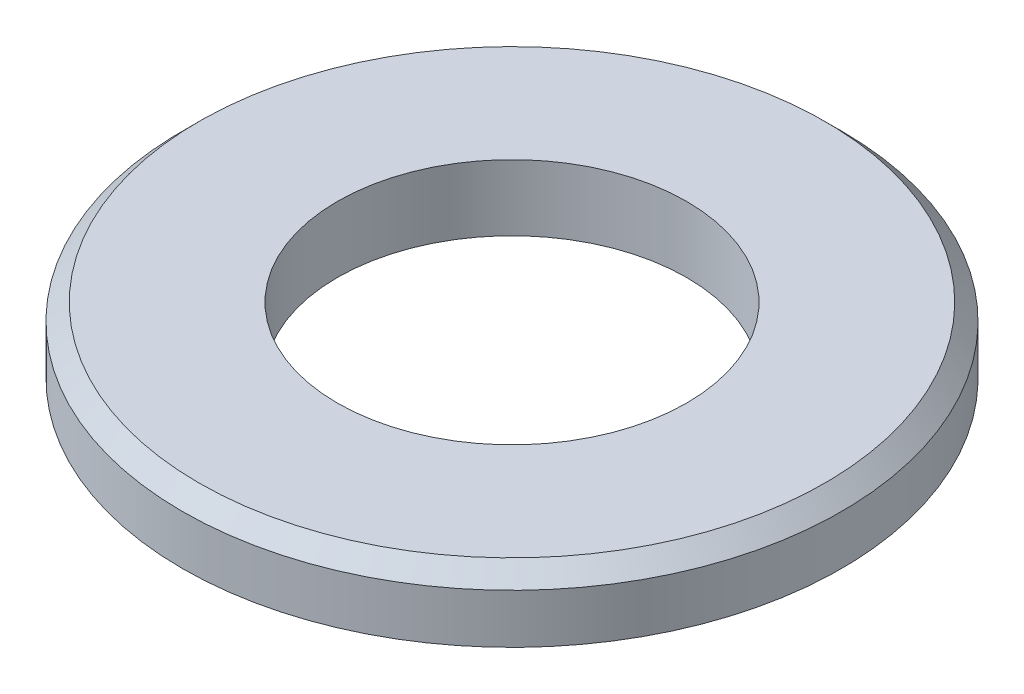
from build123d import *

# Parameters (mm, degrees)
ESQUISSE1_R          = 5
ESQUISSE1_R_2        = 2.65
BASE_EXTRUSION_DEPTH = 1
CHANFREIN3_SIZE      = 0.25


with BuildPart() as part:
    # Esquisse1 → Base-Extrusion (new body)
    with BuildSketch(Plane(origin=(0, 0, 0), x_dir=(1, 0, 0), z_dir=(0, 1, 0))):
        with Locations(Location((0, 0, 0), (0, 0, 270))):
            Circle(ESQUISSE1_R)
        with Locations(Location((0, 0, 0), (0, 0, 270))):
            Circle(ESQUISSE1_R_2, mode=Mode.SUBTRACT)
    extrude(amount=BASE_EXTRUSION_DEPTH)

    # Chanfrein3
    chanfrein3_edges = [part.edges().sort_by_distance(p)[0] for p in [
        (0, 1, -5),
    ]]
    chamfer(chanfrein3_edges, length=CHANFREIN3_SIZE)


solid = part.part
